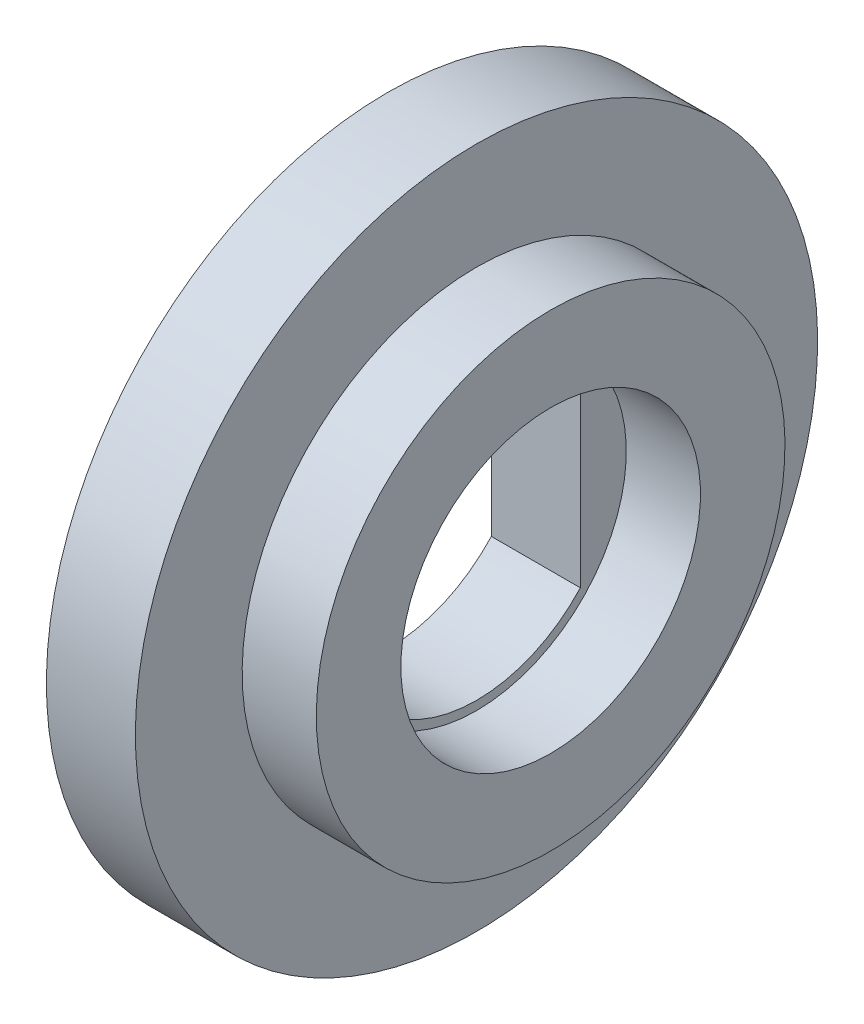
from build123d import *

# Parameters (mm, degrees)
ENL_V_MAT_EXTRU_1_DEPTH = 18.168284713


with BuildPart() as part:
    # Esquisse1 → Base-R_volution (revolve)
    with BuildSketch(Plane.XY):
        Polygon((0, 0), (0, 5.85), (1, 5.85), (1, 9.25), (0, 9.517949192), (0, 11.5), (3, 11.5), (3, 7.9), (5.5, 7.9), (5.5, 5.05), (3, 5.05), (3, 0), align=None)
    revolve(axis=Axis((11.257047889, 0, 0), (-1, 0, 0)))

    # Esquisse2 → Enl_v. mat.-Extru.1 (cut, through all)
    with BuildSketch(Plane.ZY):
        with BuildLine():
            Line((3.5, -3.211308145), (3.5, 3.211308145))
            ThreePointArc((3.5, 3.211308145), (0, 4.75), (-3.5, 3.211308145))
            Line((-3.5, 3.211308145), (-3.5, -3.211308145))
            ThreePointArc((-3.5, -3.211308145), (0, -4.75), (3.5, -3.211308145))
        make_face()
    extrude(amount=-ENL_V_MAT_EXTRU_1_DEPTH, mode=Mode.SUBTRACT)


solid = part.part
